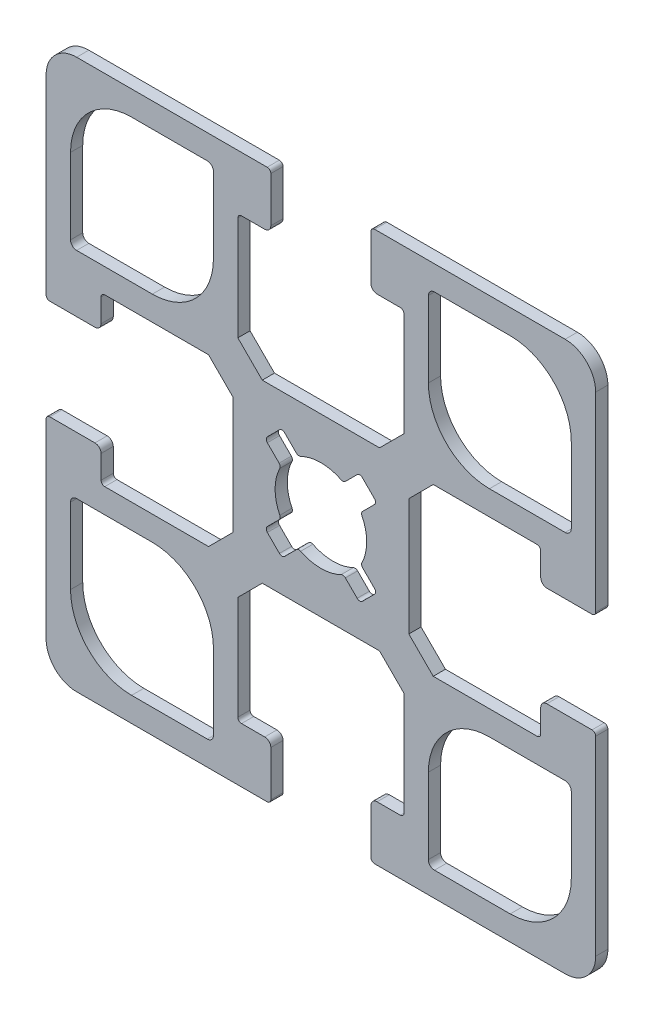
from build123d import *

# Parameters (mm, degrees)
AUFSATZ_LINEAR_AUSTRAGEN1_DEPTH = 0.5


with BuildPart() as part:
    # Model → Aufsatz-Linear austragen1 (new, symmetric)
    with BuildSketch(Plane.XY):
        with BuildLine():
            Line((9.200001, -6.8), (7.200001, -4.799999))
            Line((7.200001, -4.799999), (7.200001, 4.799999))
            Line((7.200001, 4.799999), (9.200001, 6.799999))
            Line((9.200001, 6.799999), (17.700001, 6.799999))
            ThreePointArc((17.700001, 6.799999), (17.912132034, 6.712131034), (18, 6.5))
            Line((18, 6.5), (18, 4.6))
            ThreePointArc((18, 4.6), (18.146446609, 4.246446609), (18.5, 4.1))
            Line((18.5, 4.1), (22.200001, 4.1))
            ThreePointArc((22.200001, 4.1), (22.412132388, 4.187868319), (22.5, 4.4))
            Line((22.5, 4.4), (22.5, 20))
            ThreePointArc((22.5, 20), (21.767766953, 21.767766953), (20, 22.5))
            Line((20, 22.5), (4.4, 22.5))
            ThreePointArc((4.4, 22.5), (4.187868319, 22.412132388), (4.1, 22.200001))
            Line((4.1, 22.200001), (4.1, 18.5))
            ThreePointArc((4.1, 18.5), (4.246446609, 18.146446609), (4.6, 18))
            Line((4.6, 18), (6.5, 18))
            ThreePointArc((6.5, 18), (6.712131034, 17.912132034), (6.799999, 17.700001))
            Line((6.799999, 17.700001), (6.799999, 9.200001))
            Line((6.799999, 9.200001), (4.799999, 7.200001))
            Line((4.799999, 7.200001), (-4.799999, 7.200001))
            Line((-4.799999, 7.200001), (-6.8, 9.200001))
            Line((-6.8, 9.200001), (-6.8, 17.700001))
            ThreePointArc((-6.8, 17.700001), (-6.712131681, 17.912132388), (-6.5, 18))
            Line((-6.5, 18), (-4.6, 18))
            ThreePointArc((-4.6, 18), (-4.246446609, 18.146446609), (-4.1, 18.5))
            Line((-4.1, 18.5), (-4.1, 22.200001))
            ThreePointArc((-4.1, 22.200001), (-4.187868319, 22.412132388), (-4.4, 22.5))
            Line((-4.4, 22.5), (-20, 22.5))
            ThreePointArc((-20, 22.5), (-21.767766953, 21.767766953), (-22.5, 20))
            Line((-22.5, 20), (-22.5, 4.4))
            ThreePointArc((-22.5, 4.4), (-22.412132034, 4.187867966), (-22.2, 4.1))
            Line((-22.2, 4.1), (-18.5, 4.1))
            ThreePointArc((-18.5, 4.1), (-18.146446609, 4.246446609), (-18, 4.6))
            Line((-18, 4.6), (-18, 6.5))
            ThreePointArc((-18, 6.5), (-17.912131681, 6.712131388), (-17.7, 6.799999))
            Line((-17.7, 6.799999), (-9.2, 6.799999))
            Line((-9.2, 6.799999), (-7.2, 4.799999))
            Line((-7.2, 4.799999), (-7.2, -4.799999))
            Line((-7.2, -4.799999), (-9.2, -6.8))
            Line((-9.2, -6.8), (-17.7, -6.8))
            ThreePointArc((-17.7, -6.8), (-17.912132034, -6.712132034), (-18, -6.5))
            Line((-18, -6.5), (-18, -4.6))
            ThreePointArc((-18, -4.6), (-18.146446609, -4.246446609), (-18.5, -4.1))
            Line((-18.5, -4.1), (-22.2, -4.1))
            ThreePointArc((-22.2, -4.1), (-22.412132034, -4.187867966), (-22.5, -4.4))
            Line((-22.5, -4.4), (-22.5, -20))
            ThreePointArc((-22.5, -20), (-21.767766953, -21.767766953), (-20, -22.5))
            Line((-20, -22.5), (-4.4, -22.5))
            ThreePointArc((-4.4, -22.5), (-4.187867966, -22.412132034), (-4.1, -22.2))
            Line((-4.1, -22.2), (-4.1, -18.5))
            ThreePointArc((-4.1, -18.5), (-4.246446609, -18.146446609), (-4.6, -18))
            Line((-4.6, -18), (-6.5, -18))
            ThreePointArc((-6.5, -18), (-6.712132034, -17.912132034), (-6.8, -17.7))
            Line((-6.8, -17.7), (-6.8, -9.2))
            Line((-6.8, -9.2), (-4.799999, -7.2))
            Line((-4.799999, -7.2), (4.799999, -7.2))
            Line((4.799999, -7.2), (6.799999, -9.2))
            Line((6.799999, -9.2), (6.799999, -17.7))
            ThreePointArc((6.799999, -17.7), (6.712131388, -17.912131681), (6.5, -18))
            Line((6.5, -18), (4.6, -18))
            ThreePointArc((4.6, -18), (4.246446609, -18.146446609), (4.1, -18.5))
            Line((4.1, -18.5), (4.1, -22.2))
            ThreePointArc((4.1, -22.2), (4.187867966, -22.412132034), (4.4, -22.5))
            Line((4.4, -22.5), (20, -22.5))
            ThreePointArc((20, -22.5), (21.767766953, -21.767766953), (22.5, -20))
            Line((22.5, -20), (22.5, -4.4))
            ThreePointArc((22.5, -4.4), (22.412132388, -4.187868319), (22.200001, -4.1))
            Line((22.200001, -4.1), (18.5, -4.1))
            ThreePointArc((18.5, -4.1), (18.146446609, -4.246446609), (18, -4.6))
            Line((18, -4.6), (18, -6.5))
            ThreePointArc((18, -6.5), (17.912132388, -6.712131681), (17.700001, -6.8))
            Line((17.700001, -6.8), (9.200001, -6.8))
        make_face()
        with BuildLine():
            Line((2.969848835, -4.384062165), (2.005134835, -3.419348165))
            ThreePointArc((2.005134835, -3.419348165), (1.841800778, -3.335475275), (1.660187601, -3.362481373))
            ThreePointArc((1.660187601, -3.362481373), (-1.9e-08, -3.750000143), (-1.660187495, -3.362480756))
            ThreePointArc((-1.660187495, -3.362480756), (-1.841800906, -3.335474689), (-2.005135, -3.419348))
            Line((-2.005135, -3.419348), (-2.969849, -4.384062))
            ThreePointArc((-2.969849, -4.384062), (-3.181980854, -4.471929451), (-3.3941125, -4.3840615))
            Line((-3.3941125, -4.3840615), (-4.3840615, -3.3941125))
            ThreePointArc((-4.3840615, -3.3941125), (-4.471929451, -3.181980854), (-4.384062, -2.969849))
            Line((-4.384062, -2.969849), (-3.419348, -2.005135))
            ThreePointArc((-3.419348, -2.005135), (-3.335474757, -1.84180079), (-3.362480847, -1.660187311))
            ThreePointArc((-3.362480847, -1.660187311), (-3.750000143, 2.32e-07), (-3.362481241, 1.660187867))
            ThreePointArc((-3.362481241, 1.660187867), (-3.335475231, 1.841801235), (-3.419348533, 2.005135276))
            Line((-3.419348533, 2.005135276), (-4.384062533, 2.969849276))
            ThreePointArc((-4.384062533, 2.969849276), (-4.471929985, 3.18198113), (-4.384062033, 3.394112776))
            Line((-4.384062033, 3.394112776), (-3.394113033, 4.384061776))
            ThreePointArc((-3.394113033, 4.384061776), (-3.181981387, 4.471929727), (-2.969849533, 4.384062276))
            Line((-2.969849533, 4.384062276), (-2.005135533, 3.419348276))
            ThreePointArc((-2.005135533, 3.419348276), (-1.84180132, 3.335475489), (-1.660188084, 3.362481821))
            ThreePointArc((-1.660188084, 3.362481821), (3.9e-08, 3.750001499), (1.660188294, 3.362482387))
            ThreePointArc((1.660188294, 3.362482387), (1.841801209, 3.335476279), (2.005135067, 3.419348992))
            Line((2.005135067, 3.419348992), (2.969849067, 4.384062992))
            ThreePointArc((2.969849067, 4.384062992), (3.181980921, 4.471930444), (3.394112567, 4.384062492))
            Line((3.394112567, 4.384062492), (4.384062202, 3.394112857))
            ThreePointArc((4.384062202, 3.394112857), (4.471930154, 3.181981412), (4.384062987, 2.969849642))
            Line((4.384062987, 2.969849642), (3.419348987, 2.005135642))
            ThreePointArc((3.419348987, 2.005135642), (3.33547614, 1.841801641), (3.362482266, 1.660188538))
            ThreePointArc((3.362482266, 1.660188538), (3.750001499, 8.1e-08), (3.362481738, -1.660188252))
            ThreePointArc((3.362481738, -1.660188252), (3.335475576, -1.841801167), (3.419348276, -2.005135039))
            Line((3.419348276, -2.005135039), (4.384062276, -2.969849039))
            ThreePointArc((4.384062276, -2.969849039), (4.47192957, -3.181980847), (4.384061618, -3.394112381))
            Line((4.384061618, -3.394112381), (3.394112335, -4.384061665))
            ThreePointArc((3.394112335, -4.384061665), (3.181980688, -4.471929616), (2.969848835, -4.384062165))
        make_face(mode=Mode.SUBTRACT)
        with BuildLine():
            Line((-15.5, -20.5), (-9.299995, -20.5))
            ThreePointArc((-9.299995, -20.5), (-8.946441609, -20.353553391), (-8.799995, -20))
            Line((-8.799995, -20), (-8.799995, -13.799995))
            ThreePointArc((-8.799995, -13.799995), (-10.264461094, -10.264461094), (-13.799995, -8.799995))
            Line((-13.799995, -8.799995), (-20, -8.799995))
            ThreePointArc((-20, -8.799995), (-20.353553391, -8.946441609), (-20.5, -9.299995))
            Line((-20.5, -9.299995), (-20.5, -15.5))
            ThreePointArc((-20.5, -15.5), (-19.035533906, -19.035533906), (-15.5, -20.5))
        make_face(mode=Mode.SUBTRACT)
        with BuildLine():
            Line((9.299995, -20.5), (15.5, -20.5))
            ThreePointArc((15.5, -20.5), (19.035533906, -19.035533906), (20.5, -15.5))
            Line((20.5, -15.5), (20.5, -9.299995))
            ThreePointArc((20.5, -9.299995), (20.353553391, -8.946441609), (20, -8.799995))
            Line((20, -8.799995), (13.799995, -8.799995))
            ThreePointArc((13.799995, -8.799995), (10.264461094, -10.264461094), (8.799995, -13.799995))
            Line((8.799995, -13.799995), (8.799995, -20))
            ThreePointArc((8.799995, -20), (8.946441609, -20.353553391), (9.299995, -20.5))
        make_face(mode=Mode.SUBTRACT)
        with BuildLine():
            Line((13.799995, 8.799995), (20, 8.799995))
            ThreePointArc((20, 8.799995), (20.353553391, 8.946441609), (20.5, 9.299995))
            Line((20.5, 9.299995), (20.5, 15.5))
            ThreePointArc((20.5, 15.5), (19.035533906, 19.035533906), (15.5, 20.5))
            Line((15.5, 20.5), (9.299995, 20.5))
            ThreePointArc((9.299995, 20.5), (8.946441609, 20.353553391), (8.799995, 20))
            Line((8.799995, 20), (8.799995, 13.799995))
            ThreePointArc((8.799995, 13.799995), (10.264461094, 10.264461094), (13.799995, 8.799995))
        make_face(mode=Mode.SUBTRACT)
        with BuildLine():
            Line((-20, 8.799995), (-13.799995, 8.799995))
            ThreePointArc((-13.799995, 8.799995), (-10.264461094, 10.264461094), (-8.799995, 13.799995))
            Line((-8.799995, 13.799995), (-8.799995, 20))
            ThreePointArc((-8.799995, 20), (-8.946441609, 20.353553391), (-9.299995, 20.5))
            Line((-9.299995, 20.5), (-15.5, 20.5))
            ThreePointArc((-15.5, 20.5), (-19.035533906, 19.035533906), (-20.5, 15.5))
            Line((-20.5, 15.5), (-20.5, 9.299995))
            ThreePointArc((-20.5, 9.299995), (-20.353553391, 8.946441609), (-20, 8.799995))
        make_face(mode=Mode.SUBTRACT)
    extrude(amount=AUFSATZ_LINEAR_AUSTRAGEN1_DEPTH, both=True)


solid = part.part
